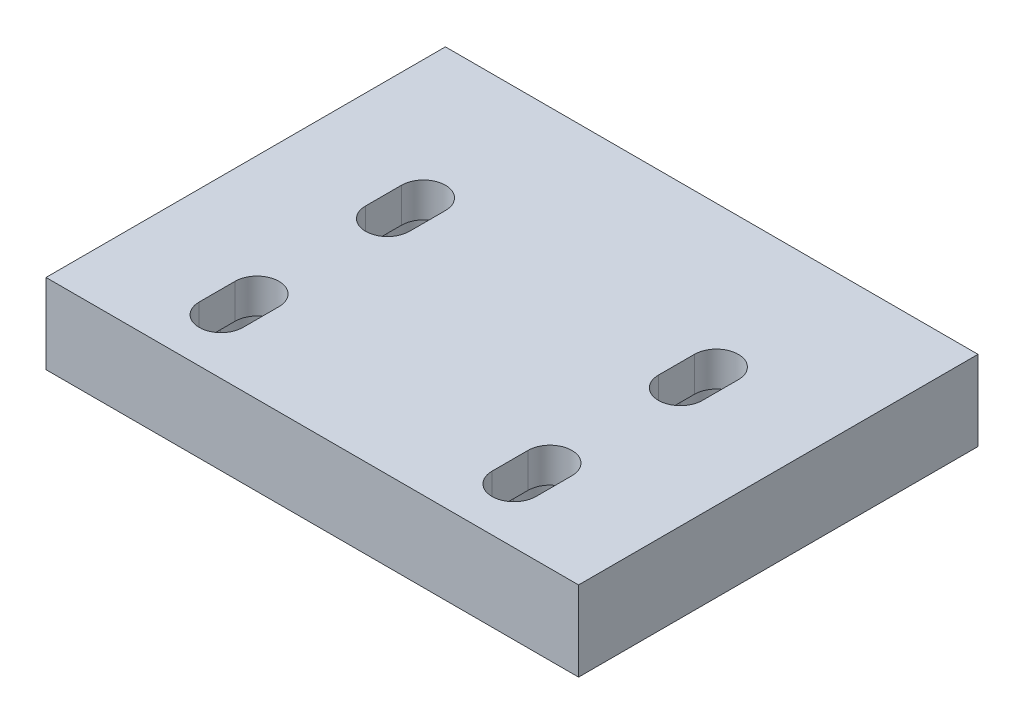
ISO-10303-21;
HEADER;
FILE_DESCRIPTION(('STEP AP214'),'2;1');
FILE_NAME('part.step','',(''),(''),'','','');
FILE_SCHEMA(('AUTOMOTIVE_DESIGN { 1 0 10303 214 1 1 1 1 }'));
ENDSEC;
DATA;
#1=APPLICATION_CONTEXT('core data for automotive mechanical design processes');
#2=APPLICATION_PROTOCOL_DEFINITION('international standard','automotive_design',2000,#1);
#3=PRODUCT_CONTEXT('',#1,'mechanical');
#4=PRODUCT('Part','Part','',(#3));
#5=PRODUCT_RELATED_PRODUCT_CATEGORY('part','',(#4));
#6=PRODUCT_DEFINITION_FORMATION('','',#4);
#7=PRODUCT_DEFINITION_CONTEXT('part definition',#1,'design');
#8=PRODUCT_DEFINITION('design','',#6,#7);
#9=PRODUCT_DEFINITION_SHAPE('','',#8);
#10=(LENGTH_UNIT() NAMED_UNIT(*) SI_UNIT(.MILLI.,.METRE.));
#11=(NAMED_UNIT(*) PLANE_ANGLE_UNIT() SI_UNIT($,.RADIAN.));
#12=(NAMED_UNIT(*) SI_UNIT($,.STERADIAN.) SOLID_ANGLE_UNIT());
#13=UNCERTAINTY_MEASURE_WITH_UNIT(LENGTH_MEASURE(1.E-05),#10,'distance_accuracy_value','');
#14=(GEOMETRIC_REPRESENTATION_CONTEXT(3) GLOBAL_UNCERTAINTY_ASSIGNED_CONTEXT((#13)) GLOBAL_UNIT_ASSIGNED_CONTEXT((#10,
#11,#12)) REPRESENTATION_CONTEXT('',''));
#15=CARTESIAN_POINT('',(0.,0.,0.));
#16=DIRECTION('',(0.,0.,1.));
#17=DIRECTION('',(1.,0.,0.));
#18=AXIS2_PLACEMENT_3D('',#15,#16,#17);
#19=CARTESIAN_POINT('',(-40.,-5.,60.));
#20=DIRECTION('',(0.,-1.,0.));
#21=DIRECTION('',(0.,0.,-1.));
#22=AXIS2_PLACEMENT_3D('',#19,#20,#21);
#23=PLANE('',#22);
#24=DIRECTION('',(0.,0.,1.));
#25=VECTOR('',#24,1.);
#26=CARTESIAN_POINT('',(25.3,-5.,21.3));
#27=LINE('',#26,#25);
#28=CARTESIAN_POINT('',(25.3,-5.,21.3));
#29=VERTEX_POINT('',#28);
#30=CARTESIAN_POINT('',(25.3,-5.,26.7));
#31=VERTEX_POINT('',#30);
#32=EDGE_CURVE('E1042',#29,#31,#27,.T.);
#33=ORIENTED_EDGE('',*,*,#32,.T.);
#34=CARTESIAN_POINT('',(22.,-5.,26.7));
#35=DIRECTION('',(0.,-1.,0.));
#36=DIRECTION('',(0.,0.,-1.));
#37=AXIS2_PLACEMENT_3D('',#34,#35,#36);
#38=CIRCLE('',#37,3.3);
#39=CARTESIAN_POINT('',(18.7,-5.,26.7));
#40=VERTEX_POINT('',#39);
#41=EDGE_CURVE('E310',#31,#40,#38,.T.);
#42=ORIENTED_EDGE('',*,*,#41,.T.);
#43=DIRECTION('',(0.,0.,1.));
#44=VECTOR('',#43,1.);
#45=CARTESIAN_POINT('',(18.7,-5.,21.3));
#46=LINE('',#45,#44);
#47=CARTESIAN_POINT('',(18.7,-5.,21.3));
#48=VERTEX_POINT('',#47);
#49=EDGE_CURVE('E1037',#48,#40,#46,.T.);
#50=ORIENTED_EDGE('',*,*,#49,.F.);
#51=CARTESIAN_POINT('',(22.,-5.,21.3));
#52=DIRECTION('',(0.,-1.,0.));
#53=DIRECTION('',(0.,0.,-1.));
#54=AXIS2_PLACEMENT_3D('',#51,#52,#53);
#55=CIRCLE('',#54,3.3);
#56=EDGE_CURVE('E292',#48,#29,#55,.T.);
#57=ORIENTED_EDGE('',*,*,#56,.T.);
#58=EDGE_LOOP('',(#33,#42,#50,#57));
#59=FACE_BOUND('',#58,.T.);
#60=DIRECTION('',(-1.,0.,0.));
#61=VECTOR('',#60,1.);
#62=CARTESIAN_POINT('',(-40.,-5.,0.));
#63=LINE('',#62,#61);
#64=CARTESIAN_POINT('',(40.,-5.,0.));
#65=VERTEX_POINT('',#64);
#66=CARTESIAN_POINT('',(-40.,-5.,0.));
#67=VERTEX_POINT('',#66);
#68=EDGE_CURVE('E519',#65,#67,#63,.T.);
#69=ORIENTED_EDGE('',*,*,#68,.T.);
#70=DIRECTION('',(0.,0.,-1.));
#71=VECTOR('',#70,1.);
#72=CARTESIAN_POINT('',(-40.,-5.,60.));
#73=LINE('',#72,#71);
#74=CARTESIAN_POINT('',(-40.,-5.,60.));
#75=VERTEX_POINT('',#74);
#76=EDGE_CURVE('E525',#75,#67,#73,.T.);
#77=ORIENTED_EDGE('',*,*,#76,.F.);
#78=DIRECTION('',(-1.,0.,0.));
#79=VECTOR('',#78,1.);
#80=CARTESIAN_POINT('',(-40.,-5.,60.));
#81=LINE('',#80,#79);
#82=CARTESIAN_POINT('',(40.,-5.,60.));
#83=VERTEX_POINT('',#82);
#84=EDGE_CURVE('E523',#83,#75,#81,.T.);
#85=ORIENTED_EDGE('',*,*,#84,.F.);
#86=DIRECTION('',(0.,0.,-1.));
#87=VECTOR('',#86,1.);
#88=CARTESIAN_POINT('',(40.,-5.,60.));
#89=LINE('',#88,#87);
#90=EDGE_CURVE('E535',#83,#65,#89,.T.);
#91=ORIENTED_EDGE('',*,*,#90,.T.);
#92=EDGE_LOOP('',(#69,#77,#85,#91));
#93=FACE_BOUND('',#92,.T.);
#94=DIRECTION('',(0.,0.,1.));
#95=VECTOR('',#94,1.);
#96=CARTESIAN_POINT('',(-18.7,-5.,46.3));
#97=LINE('',#96,#95);
#98=CARTESIAN_POINT('',(-18.7,-5.,46.3));
#99=VERTEX_POINT('',#98);
#100=CARTESIAN_POINT('',(-18.7,-5.,51.7));
#101=VERTEX_POINT('',#100);
#102=EDGE_CURVE('E441',#99,#101,#97,.T.);
#103=ORIENTED_EDGE('',*,*,#102,.T.);
#104=CARTESIAN_POINT('',(-22.,-5.,51.7));
#105=DIRECTION('',(0.,-1.,0.));
#106=DIRECTION('',(0.,0.,-1.));
#107=AXIS2_PLACEMENT_3D('',#104,#105,#106);
#108=CIRCLE('',#107,3.3);
#109=CARTESIAN_POINT('',(-25.3,-5.,51.7));
#110=VERTEX_POINT('',#109);
#111=EDGE_CURVE('E491',#101,#110,#108,.T.);
#112=ORIENTED_EDGE('',*,*,#111,.T.);
#113=DIRECTION('',(0.,0.,1.));
#114=VECTOR('',#113,1.);
#115=CARTESIAN_POINT('',(-25.3,-5.,46.3));
#116=LINE('',#115,#114);
#117=CARTESIAN_POINT('',(-25.3,-5.,46.3));
#118=VERTEX_POINT('',#117);
#119=EDGE_CURVE('E444',#118,#110,#116,.T.);
#120=ORIENTED_EDGE('',*,*,#119,.F.);
#121=CARTESIAN_POINT('',(-22.,-5.,46.3));
#122=DIRECTION('',(0.,-1.,0.));
#123=DIRECTION('',(0.,0.,-1.));
#124=AXIS2_PLACEMENT_3D('',#121,#122,#123);
#125=CIRCLE('',#124,3.3);
#126=EDGE_CURVE('E468',#118,#99,#125,.T.);
#127=ORIENTED_EDGE('',*,*,#126,.T.);
#128=EDGE_LOOP('',(#103,#112,#120,#127));
#129=FACE_BOUND('',#128,.T.);
#130=DIRECTION('',(0.,0.,1.));
#131=VECTOR('',#130,1.);
#132=CARTESIAN_POINT('',(-18.7,-5.,21.3));
#133=LINE('',#132,#131);
#134=CARTESIAN_POINT('',(-18.7,-5.,21.3));
#135=VERTEX_POINT('',#134);
#136=CARTESIAN_POINT('',(-18.7,-5.,26.7));
#137=VERTEX_POINT('',#136);
#138=EDGE_CURVE('E381',#135,#137,#133,.T.);
#139=ORIENTED_EDGE('',*,*,#138,.T.);
#140=CARTESIAN_POINT('',(-22.,-5.,26.7));
#141=DIRECTION('',(0.,-1.,0.));
#142=DIRECTION('',(0.,0.,-1.));
#143=AXIS2_PLACEMENT_3D('',#140,#141,#142);
#144=CIRCLE('',#143,3.3);
#145=CARTESIAN_POINT('',(-25.3,-5.,26.7));
#146=VERTEX_POINT('',#145);
#147=EDGE_CURVE('E430',#137,#146,#144,.T.);
#148=ORIENTED_EDGE('',*,*,#147,.T.);
#149=DIRECTION('',(0.,0.,1.));
#150=VECTOR('',#149,1.);
#151=CARTESIAN_POINT('',(-25.3,-5.,21.3));
#152=LINE('',#151,#150);
#153=CARTESIAN_POINT('',(-25.3,-5.,21.3));
#154=VERTEX_POINT('',#153);
#155=EDGE_CURVE('E384',#154,#146,#152,.T.);
#156=ORIENTED_EDGE('',*,*,#155,.F.);
#157=CARTESIAN_POINT('',(-22.,-5.,21.3));
#158=DIRECTION('',(0.,-1.,0.));
#159=DIRECTION('',(0.,0.,-1.));
#160=AXIS2_PLACEMENT_3D('',#157,#158,#159);
#161=CIRCLE('',#160,3.3);
#162=EDGE_CURVE('E408',#154,#135,#161,.T.);
#163=ORIENTED_EDGE('',*,*,#162,.T.);
#164=EDGE_LOOP('',(#139,#148,#156,#163));
#165=FACE_BOUND('',#164,.T.);
#166=DIRECTION('',(0.,0.,1.));
#167=VECTOR('',#166,1.);
#168=CARTESIAN_POINT('',(18.7,-5.,46.3));
#169=LINE('',#168,#167);
#170=CARTESIAN_POINT('',(18.7,-5.,46.3));
#171=VERTEX_POINT('',#170);
#172=CARTESIAN_POINT('',(18.7,-5.,51.7));
#173=VERTEX_POINT('',#172);
#174=EDGE_CURVE('E324',#171,#173,#169,.T.);
#175=ORIENTED_EDGE('',*,*,#174,.F.);
#176=CARTESIAN_POINT('',(22.,-5.,46.3));
#177=DIRECTION('',(0.,-1.,0.));
#178=DIRECTION('',(0.,0.,-1.));
#179=AXIS2_PLACEMENT_3D('',#176,#177,#178);
#180=CIRCLE('',#179,3.3);
#181=CARTESIAN_POINT('',(25.3,-5.,46.3));
#182=VERTEX_POINT('',#181);
#183=EDGE_CURVE('E348',#171,#182,#180,.T.);
#184=ORIENTED_EDGE('',*,*,#183,.T.);
#185=DIRECTION('',(0.,0.,1.));
#186=VECTOR('',#185,1.);
#187=CARTESIAN_POINT('',(25.3,-5.,46.3));
#188=LINE('',#187,#186);
#189=CARTESIAN_POINT('',(25.3,-5.,51.7));
#190=VERTEX_POINT('',#189);
#191=EDGE_CURVE('E321',#182,#190,#188,.T.);
#192=ORIENTED_EDGE('',*,*,#191,.T.);
#193=CARTESIAN_POINT('',(22.,-5.,51.7));
#194=DIRECTION('',(0.,-1.,0.));
#195=DIRECTION('',(0.,0.,-1.));
#196=AXIS2_PLACEMENT_3D('',#193,#194,#195);
#197=CIRCLE('',#196,3.3);
#198=EDGE_CURVE('E370',#190,#173,#197,.T.);
#199=ORIENTED_EDGE('',*,*,#198,.T.);
#200=EDGE_LOOP('',(#175,#184,#192,#199));
#201=FACE_BOUND('',#200,.T.);
#202=ADVANCED_FACE('F16',(#59,#93,#129,#165,#201),#23,.F.);
#203=CARTESIAN_POINT('',(-40.,-5.,60.));
#204=DIRECTION('',(1.,0.,0.));
#205=DIRECTION('',(0.,0.,-1.));
#206=AXIS2_PLACEMENT_3D('',#203,#204,#205);
#207=PLANE('',#206);
#208=DIRECTION('',(0.,-1.,0.));
#209=VECTOR('',#208,1.);
#210=CARTESIAN_POINT('',(-40.,-5.,0.));
#211=LINE('',#210,#209);
#212=CARTESIAN_POINT('',(-40.,-17.,0.));
#213=VERTEX_POINT('',#212);
#214=EDGE_CURVE('E514',#67,#213,#211,.T.);
#215=ORIENTED_EDGE('',*,*,#214,.T.);
#216=DIRECTION('',(0.,0.,-1.));
#217=VECTOR('',#216,1.);
#218=CARTESIAN_POINT('',(-40.,-17.,60.));
#219=LINE('',#218,#217);
#220=CARTESIAN_POINT('',(-40.,-17.,60.));
#221=VERTEX_POINT('',#220);
#222=EDGE_CURVE('E11',#221,#213,#219,.T.);
#223=ORIENTED_EDGE('',*,*,#222,.F.);
#224=DIRECTION('',(0.,-1.,0.));
#225=VECTOR('',#224,1.);
#226=CARTESIAN_POINT('',(-40.,-5.,60.));
#227=LINE('',#226,#225);
#228=EDGE_CURVE('E515',#75,#221,#227,.T.);
#229=ORIENTED_EDGE('',*,*,#228,.F.);
#230=ORIENTED_EDGE('',*,*,#76,.T.);
#231=EDGE_LOOP('',(#215,#223,#229,#230));
#232=FACE_BOUND('',#231,.T.);
#233=ADVANCED_FACE('F18',(#232),#207,.F.);
#234=CARTESIAN_POINT('',(-40.,-17.,60.));
#235=DIRECTION('',(0.,1.,0.));
#236=DIRECTION('',(0.,0.,1.));
#237=AXIS2_PLACEMENT_3D('',#234,#235,#236);
#238=PLANE('',#237);
#239=DIRECTION('',(0.,0.,1.));
#240=VECTOR('',#239,1.);
#241=CARTESIAN_POINT('',(16.5,-17.,21.3));
#242=LINE('',#241,#240);
#243=CARTESIAN_POINT('',(16.5,-17.,21.3));
#244=VERTEX_POINT('',#243);
#245=CARTESIAN_POINT('',(16.5,-17.,26.7));
#246=VERTEX_POINT('',#245);
#247=EDGE_CURVE('E286',#244,#246,#242,.T.);
#248=ORIENTED_EDGE('',*,*,#247,.T.);
#249=CARTESIAN_POINT('',(22.,-17.,26.7));
#250=DIRECTION('',(0.,-1.,0.));
#251=DIRECTION('',(0.,0.,-1.));
#252=AXIS2_PLACEMENT_3D('',#249,#250,#251);
#253=CIRCLE('',#252,5.5);
#254=CARTESIAN_POINT('',(27.5,-17.,26.7));
#255=VERTEX_POINT('',#254);
#256=EDGE_CURVE('E302',#255,#246,#253,.T.);
#257=ORIENTED_EDGE('',*,*,#256,.F.);
#258=DIRECTION('',(0.,0.,1.));
#259=VECTOR('',#258,1.);
#260=CARTESIAN_POINT('',(27.5,-17.,21.3));
#261=LINE('',#260,#259);
#262=CARTESIAN_POINT('',(27.5,-17.,21.3));
#263=VERTEX_POINT('',#262);
#264=EDGE_CURVE('E276',#263,#255,#261,.T.);
#265=ORIENTED_EDGE('',*,*,#264,.F.);
#266=CARTESIAN_POINT('',(22.,-17.,21.3));
#267=DIRECTION('',(0.,-1.,0.));
#268=DIRECTION('',(0.,0.,-1.));
#269=AXIS2_PLACEMENT_3D('',#266,#267,#268);
#270=CIRCLE('',#269,5.5);
#271=EDGE_CURVE('E269',#244,#263,#270,.T.);
#272=ORIENTED_EDGE('',*,*,#271,.F.);
#273=EDGE_LOOP('',(#248,#257,#265,#272));
#274=FACE_BOUND('',#273,.T.);
#275=CARTESIAN_POINT('',(22.,-17.,46.3));
#276=DIRECTION('',(0.,-1.,0.));
#277=DIRECTION('',(0.,0.,-1.));
#278=AXIS2_PLACEMENT_3D('',#275,#276,#277);
#279=CIRCLE('',#278,5.5);
#280=CARTESIAN_POINT('',(16.5,-17.,46.3));
#281=VERTEX_POINT('',#280);
#282=CARTESIAN_POINT('',(27.5,-17.,46.3));
#283=VERTEX_POINT('',#282);
#284=EDGE_CURVE('E341',#281,#283,#279,.T.);
#285=ORIENTED_EDGE('',*,*,#284,.F.);
#286=DIRECTION('',(0.,0.,1.));
#287=VECTOR('',#286,1.);
#288=CARTESIAN_POINT('',(16.5,-17.,46.3));
#289=LINE('',#288,#287);
#290=CARTESIAN_POINT('',(16.5,-17.,51.7));
#291=VERTEX_POINT('',#290);
#292=EDGE_CURVE('E330',#281,#291,#289,.T.);
#293=ORIENTED_EDGE('',*,*,#292,.T.);
#294=CARTESIAN_POINT('',(22.,-17.,51.7));
#295=DIRECTION('',(0.,-1.,0.));
#296=DIRECTION('',(0.,0.,-1.));
#297=AXIS2_PLACEMENT_3D('',#294,#295,#296);
#298=CIRCLE('',#297,5.5);
#299=CARTESIAN_POINT('',(27.5,-17.,51.7));
#300=VERTEX_POINT('',#299);
#301=EDGE_CURVE('E361',#300,#291,#298,.T.);
#302=ORIENTED_EDGE('',*,*,#301,.F.);
#303=DIRECTION('',(0.,0.,1.));
#304=VECTOR('',#303,1.);
#305=CARTESIAN_POINT('',(27.5,-17.,46.3));
#306=LINE('',#305,#304);
#307=EDGE_CURVE('E315',#283,#300,#306,.T.);
#308=ORIENTED_EDGE('',*,*,#307,.F.);
#309=EDGE_LOOP('',(#285,#293,#302,#308));
#310=FACE_BOUND('',#309,.T.);
#311=CARTESIAN_POINT('',(-22.,-17.,21.3));
#312=DIRECTION('',(0.,-1.,0.));
#313=DIRECTION('',(0.,0.,-1.));
#314=AXIS2_PLACEMENT_3D('',#311,#312,#313);
#315=CIRCLE('',#314,5.5);
#316=CARTESIAN_POINT('',(-27.5,-17.,21.3));
#317=VERTEX_POINT('',#316);
#318=CARTESIAN_POINT('',(-16.5,-17.,21.3));
#319=VERTEX_POINT('',#318);
#320=EDGE_CURVE('E401',#317,#319,#315,.T.);
#321=ORIENTED_EDGE('',*,*,#320,.F.);
#322=DIRECTION('',(0.,0.,1.));
#323=VECTOR('',#322,1.);
#324=CARTESIAN_POINT('',(-27.5,-17.,21.3));
#325=LINE('',#324,#323);
#326=CARTESIAN_POINT('',(-27.5,-17.,26.7));
#327=VERTEX_POINT('',#326);
#328=EDGE_CURVE('E390',#317,#327,#325,.T.);
#329=ORIENTED_EDGE('',*,*,#328,.T.);
#330=CARTESIAN_POINT('',(-22.,-17.,26.7));
#331=DIRECTION('',(0.,-1.,0.));
#332=DIRECTION('',(0.,0.,-1.));
#333=AXIS2_PLACEMENT_3D('',#330,#331,#332);
#334=CIRCLE('',#333,5.5);
#335=CARTESIAN_POINT('',(-16.5,-17.,26.7));
#336=VERTEX_POINT('',#335);
#337=EDGE_CURVE('E421',#336,#327,#334,.T.);
#338=ORIENTED_EDGE('',*,*,#337,.F.);
#339=DIRECTION('',(0.,0.,1.));
#340=VECTOR('',#339,1.);
#341=CARTESIAN_POINT('',(-16.5,-17.,21.3));
#342=LINE('',#341,#340);
#343=EDGE_CURVE('E375',#319,#336,#342,.T.);
#344=ORIENTED_EDGE('',*,*,#343,.F.);
#345=EDGE_LOOP('',(#321,#329,#338,#344));
#346=FACE_BOUND('',#345,.T.);
#347=DIRECTION('',(0.,0.,1.));
#348=VECTOR('',#347,1.);
#349=CARTESIAN_POINT('',(-27.5,-17.,46.3));
#350=LINE('',#349,#348);
#351=CARTESIAN_POINT('',(-27.5,-17.,46.3));
#352=VERTEX_POINT('',#351);
#353=CARTESIAN_POINT('',(-27.5,-17.,51.7));
#354=VERTEX_POINT('',#353);
#355=EDGE_CURVE('E450',#352,#354,#350,.T.);
#356=ORIENTED_EDGE('',*,*,#355,.T.);
#357=CARTESIAN_POINT('',(-22.,-17.,51.7));
#358=DIRECTION('',(0.,-1.,0.));
#359=DIRECTION('',(0.,0.,-1.));
#360=AXIS2_PLACEMENT_3D('',#357,#358,#359);
#361=CIRCLE('',#360,5.5);
#362=CARTESIAN_POINT('',(-16.5,-17.,51.7));
#363=VERTEX_POINT('',#362);
#364=EDGE_CURVE('E482',#363,#354,#361,.T.);
#365=ORIENTED_EDGE('',*,*,#364,.F.);
#366=DIRECTION('',(0.,0.,1.));
#367=VECTOR('',#366,1.);
#368=CARTESIAN_POINT('',(-16.5,-17.,46.3));
#369=LINE('',#368,#367);
#370=CARTESIAN_POINT('',(-16.5,-17.,46.3));
#371=VERTEX_POINT('',#370);
#372=EDGE_CURVE('E435',#371,#363,#369,.T.);
#373=ORIENTED_EDGE('',*,*,#372,.F.);
#374=CARTESIAN_POINT('',(-22.,-17.,46.3));
#375=DIRECTION('',(0.,-1.,0.));
#376=DIRECTION('',(0.,0.,-1.));
#377=AXIS2_PLACEMENT_3D('',#374,#375,#376);
#378=CIRCLE('',#377,5.5);
#379=EDGE_CURVE('E462',#352,#371,#378,.T.);
#380=ORIENTED_EDGE('',*,*,#379,.F.);
#381=EDGE_LOOP('',(#356,#365,#373,#380));
#382=FACE_BOUND('',#381,.T.);
#383=DIRECTION('',(1.,0.,0.));
#384=VECTOR('',#383,1.);
#385=CARTESIAN_POINT('',(-40.,-17.,0.));
#386=LINE('',#385,#384);
#387=CARTESIAN_POINT('',(40.,-17.,0.));
#388=VERTEX_POINT('',#387);
#389=EDGE_CURVE('E528',#213,#388,#386,.T.);
#390=ORIENTED_EDGE('',*,*,#389,.T.);
#391=DIRECTION('',(0.,0.,-1.));
#392=VECTOR('',#391,1.);
#393=CARTESIAN_POINT('',(40.,-17.,60.));
#394=LINE('',#393,#392);
#395=CARTESIAN_POINT('',(40.,-17.,60.));
#396=VERTEX_POINT('',#395);
#397=EDGE_CURVE('E24',#396,#388,#394,.T.);
#398=ORIENTED_EDGE('',*,*,#397,.F.);
#399=DIRECTION('',(1.,0.,0.));
#400=VECTOR('',#399,1.);
#401=CARTESIAN_POINT('',(-40.,-17.,60.));
#402=LINE('',#401,#400);
#403=EDGE_CURVE('E518',#221,#396,#402,.T.);
#404=ORIENTED_EDGE('',*,*,#403,.F.);
#405=ORIENTED_EDGE('',*,*,#222,.T.);
#406=EDGE_LOOP('',(#390,#398,#404,#405));
#407=FACE_BOUND('',#406,.T.);
#408=ADVANCED_FACE('F558',(#274,#310,#346,#382,#407),#238,.F.);
#409=CARTESIAN_POINT('',(40.,-5.,60.));
#410=DIRECTION('',(-1.,0.,0.));
#411=DIRECTION('',(0.,0.,1.));
#412=AXIS2_PLACEMENT_3D('',#409,#410,#411);
#413=PLANE('',#412);
#414=DIRECTION('',(0.,1.,0.));
#415=VECTOR('',#414,1.);
#416=CARTESIAN_POINT('',(40.,-5.,0.));
#417=LINE('',#416,#415);
#418=EDGE_CURVE('E530',#388,#65,#417,.T.);
#419=ORIENTED_EDGE('',*,*,#418,.T.);
#420=ORIENTED_EDGE('',*,*,#90,.F.);
#421=DIRECTION('',(0.,1.,0.));
#422=VECTOR('',#421,1.);
#423=CARTESIAN_POINT('',(40.,-5.,60.));
#424=LINE('',#423,#422);
#425=EDGE_CURVE('E521',#396,#83,#424,.T.);
#426=ORIENTED_EDGE('',*,*,#425,.F.);
#427=ORIENTED_EDGE('',*,*,#397,.T.);
#428=EDGE_LOOP('',(#419,#420,#426,#427));
#429=FACE_BOUND('',#428,.T.);
#430=ADVANCED_FACE('F542',(#429),#413,.F.);
#431=CARTESIAN_POINT('',(0.,0.,60.));
#432=DIRECTION('',(0.,0.,1.));
#433=DIRECTION('',(1.,0.,0.));
#434=AXIS2_PLACEMENT_3D('',#431,#432,#433);
#435=PLANE('',#434);
#436=ORIENTED_EDGE('',*,*,#228,.T.);
#437=ORIENTED_EDGE('',*,*,#403,.T.);
#438=ORIENTED_EDGE('',*,*,#425,.T.);
#439=ORIENTED_EDGE('',*,*,#84,.T.);
#440=EDGE_LOOP('',(#436,#437,#438,#439));
#441=FACE_BOUND('',#440,.T.);
#442=ADVANCED_FACE('F557',(#441),#435,.T.);
#443=CARTESIAN_POINT('',(0.,0.,0.));
#444=DIRECTION('',(0.,0.,1.));
#445=DIRECTION('',(1.,0.,0.));
#446=AXIS2_PLACEMENT_3D('',#443,#444,#445);
#447=PLANE('',#446);
#448=CARTESIAN_POINT('',(28.,-11.,0.));
#449=DIRECTION('',(0.,0.,-1.));
#450=DIRECTION('',(-1.,0.,0.));
#451=AXIS2_PLACEMENT_3D('',#448,#449,#450);
#452=CIRCLE('',#451,2.1);
#453=CARTESIAN_POINT('',(25.9,-11.,0.));
#454=VERTEX_POINT('',#453);
#455=EDGE_CURVE('E496',#454,#454,#452,.T.);
#456=ORIENTED_EDGE('',*,*,#455,.F.);
#457=EDGE_LOOP('',(#456));
#458=FACE_BOUND('',#457,.T.);
#459=CARTESIAN_POINT('',(0.,-11.,0.));
#460=DIRECTION('',(0.,0.,-1.));
#461=DIRECTION('',(-1.,0.,0.));
#462=AXIS2_PLACEMENT_3D('',#459,#460,#461);
#463=CIRCLE('',#462,2.1);
#464=CARTESIAN_POINT('',(-2.1,-11.,0.));
#465=VERTEX_POINT('',#464);
#466=EDGE_CURVE('E502',#465,#465,#463,.T.);
#467=ORIENTED_EDGE('',*,*,#466,.F.);
#468=EDGE_LOOP('',(#467));
#469=FACE_BOUND('',#468,.T.);
#470=CARTESIAN_POINT('',(-28.,-11.,0.));
#471=DIRECTION('',(0.,0.,-1.));
#472=DIRECTION('',(-1.,0.,0.));
#473=AXIS2_PLACEMENT_3D('',#470,#471,#472);
#474=CIRCLE('',#473,2.1);
#475=CARTESIAN_POINT('',(-30.1,-11.,0.));
#476=VERTEX_POINT('',#475);
#477=EDGE_CURVE('E508',#476,#476,#474,.T.);
#478=ORIENTED_EDGE('',*,*,#477,.F.);
#479=EDGE_LOOP('',(#478));
#480=FACE_BOUND('',#479,.T.);
#481=ORIENTED_EDGE('',*,*,#214,.F.);
#482=ORIENTED_EDGE('',*,*,#68,.F.);
#483=ORIENTED_EDGE('',*,*,#418,.F.);
#484=ORIENTED_EDGE('',*,*,#389,.F.);
#485=EDGE_LOOP('',(#481,#482,#483,#484));
#486=FACE_BOUND('',#485,.T.);
#487=ADVANCED_FACE('F548',(#458,#469,#480,#486),#447,.F.);
#488=CARTESIAN_POINT('',(-28.,-11.,16.));
#489=DIRECTION('',(0.,0.,-1.));
#490=DIRECTION('',(-1.,0.,0.));
#491=AXIS2_PLACEMENT_3D('',#488,#489,#490);
#492=CONICAL_SURFACE('',#491,2.1,1.02974425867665);
#493=CARTESIAN_POINT('',(-28.,-11.,17.2618072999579));
#494=VERTEX_POINT('',#493);
#495=VERTEX_LOOP('',#494);
#496=FACE_BOUND('',#495,.T.);
#497=CARTESIAN_POINT('',(-28.,-11.,16.));
#498=DIRECTION('',(0.,0.,-1.));
#499=DIRECTION('',(-1.,0.,0.));
#500=AXIS2_PLACEMENT_3D('',#497,#498,#499);
#501=CIRCLE('',#500,2.1);
#502=CARTESIAN_POINT('',(-30.1,-11.,16.));
#503=VERTEX_POINT('',#502);
#504=EDGE_CURVE('E511',#503,#503,#501,.T.);
#505=ORIENTED_EDGE('',*,*,#504,.T.);
#506=EDGE_LOOP('',(#505));
#507=FACE_BOUND('',#506,.T.);
#508=ADVANCED_FACE('F580',(#496,#507),#492,.F.);
#509=CARTESIAN_POINT('',(-28.,-11.,0.));
#510=DIRECTION('',(0.,0.,-1.));
#511=DIRECTION('',(-1.,0.,0.));
#512=AXIS2_PLACEMENT_3D('',#509,#510,#511);
#513=CYLINDRICAL_SURFACE('',#512,2.1);
#514=ORIENTED_EDGE('',*,*,#504,.F.);
#515=EDGE_LOOP('',(#514));
#516=FACE_BOUND('',#515,.T.);
#517=ORIENTED_EDGE('',*,*,#477,.T.);
#518=EDGE_LOOP('',(#517));
#519=FACE_BOUND('',#518,.T.);
#520=ADVANCED_FACE('F586',(#516,#519),#513,.F.);
#521=CARTESIAN_POINT('',(0.,-11.,16.));
#522=DIRECTION('',(0.,0.,-1.));
#523=DIRECTION('',(-1.,0.,0.));
#524=AXIS2_PLACEMENT_3D('',#521,#522,#523);
#525=CONICAL_SURFACE('',#524,2.1,1.02974425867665);
#526=CARTESIAN_POINT('',(0.,-11.,17.2618072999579));
#527=VERTEX_POINT('',#526);
#528=VERTEX_LOOP('',#527);
#529=FACE_BOUND('',#528,.T.);
#530=CARTESIAN_POINT('',(0.,-11.,16.));
#531=DIRECTION('',(0.,0.,-1.));
#532=DIRECTION('',(-1.,0.,0.));
#533=AXIS2_PLACEMENT_3D('',#530,#531,#532);
#534=CIRCLE('',#533,2.1);
#535=CARTESIAN_POINT('',(-2.1,-11.,16.));
#536=VERTEX_POINT('',#535);
#537=EDGE_CURVE('E505',#536,#536,#534,.T.);
#538=ORIENTED_EDGE('',*,*,#537,.T.);
#539=EDGE_LOOP('',(#538));
#540=FACE_BOUND('',#539,.T.);
#541=ADVANCED_FACE('F590',(#529,#540),#525,.F.);
#542=CARTESIAN_POINT('',(0.,-11.,0.));
#543=DIRECTION('',(0.,0.,-1.));
#544=DIRECTION('',(-1.,0.,0.));
#545=AXIS2_PLACEMENT_3D('',#542,#543,#544);
#546=CYLINDRICAL_SURFACE('',#545,2.1);
#547=ORIENTED_EDGE('',*,*,#537,.F.);
#548=EDGE_LOOP('',(#547));
#549=FACE_BOUND('',#548,.T.);
#550=ORIENTED_EDGE('',*,*,#466,.T.);
#551=EDGE_LOOP('',(#550));
#552=FACE_BOUND('',#551,.T.);
#553=ADVANCED_FACE('F594',(#549,#552),#546,.F.);
#554=CARTESIAN_POINT('',(28.,-11.,16.));
#555=DIRECTION('',(0.,0.,-1.));
#556=DIRECTION('',(-1.,0.,0.));
#557=AXIS2_PLACEMENT_3D('',#554,#555,#556);
#558=CONICAL_SURFACE('',#557,2.1,1.02974425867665);
#559=CARTESIAN_POINT('',(28.,-11.,17.2618072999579));
#560=VERTEX_POINT('',#559);
#561=VERTEX_LOOP('',#560);
#562=FACE_BOUND('',#561,.T.);
#563=CARTESIAN_POINT('',(28.,-11.,16.));
#564=DIRECTION('',(0.,0.,-1.));
#565=DIRECTION('',(-1.,0.,0.));
#566=AXIS2_PLACEMENT_3D('',#563,#564,#565);
#567=CIRCLE('',#566,2.1);
#568=CARTESIAN_POINT('',(25.9,-11.,16.));
#569=VERTEX_POINT('',#568);
#570=EDGE_CURVE('E499',#569,#569,#567,.T.);
#571=ORIENTED_EDGE('',*,*,#570,.T.);
#572=EDGE_LOOP('',(#571));
#573=FACE_BOUND('',#572,.T.);
#574=ADVANCED_FACE('F598',(#562,#573),#558,.F.);
#575=CARTESIAN_POINT('',(28.,-11.,0.));
#576=DIRECTION('',(0.,0.,-1.));
#577=DIRECTION('',(-1.,0.,0.));
#578=AXIS2_PLACEMENT_3D('',#575,#576,#577);
#579=CYLINDRICAL_SURFACE('',#578,2.1);
#580=ORIENTED_EDGE('',*,*,#570,.F.);
#581=EDGE_LOOP('',(#580));
#582=FACE_BOUND('',#581,.T.);
#583=ORIENTED_EDGE('',*,*,#455,.T.);
#584=EDGE_LOOP('',(#583));
#585=FACE_BOUND('',#584,.T.);
#586=ADVANCED_FACE('F602',(#582,#585),#579,.F.);
#587=CARTESIAN_POINT('',(-22.,-17.,51.7));
#588=DIRECTION('',(0.,-1.,0.));
#589=DIRECTION('',(0.,0.,-1.));
#590=AXIS2_PLACEMENT_3D('',#587,#588,#589);
#591=CYLINDRICAL_SURFACE('',#590,3.3);
#592=ORIENTED_EDGE('',*,*,#111,.F.);
#593=DIRECTION('',(0.,1.,0.));
#594=VECTOR('',#593,1.);
#595=CARTESIAN_POINT('',(-18.7,-5.,51.7));
#596=LINE('',#595,#594);
#597=CARTESIAN_POINT('',(-18.7,-10.2,51.7));
#598=VERTEX_POINT('',#597);
#599=EDGE_CURVE('E479',#598,#101,#596,.T.);
#600=ORIENTED_EDGE('',*,*,#599,.F.);
#601=CARTESIAN_POINT('',(-22.,-10.2,51.7));
#602=DIRECTION('',(0.,-1.,0.));
#603=DIRECTION('',(0.,0.,-1.));
#604=AXIS2_PLACEMENT_3D('',#601,#602,#603);
#605=CIRCLE('',#604,3.3);
#606=CARTESIAN_POINT('',(-25.3,-10.2,51.7));
#607=VERTEX_POINT('',#606);
#608=EDGE_CURVE('E488',#598,#607,#605,.T.);
#609=ORIENTED_EDGE('',*,*,#608,.T.);
#610=DIRECTION('',(0.,-1.,0.));
#611=VECTOR('',#610,1.);
#612=CARTESIAN_POINT('',(-25.3,-17.,51.7));
#613=LINE('',#612,#611);
#614=EDGE_CURVE('E473',#110,#607,#613,.T.);
#615=ORIENTED_EDGE('',*,*,#614,.F.);
#616=EDGE_LOOP('',(#592,#600,#609,#615));
#617=FACE_BOUND('',#616,.T.);
#618=ADVANCED_FACE('F606',(#617),#591,.F.);
#619=CARTESIAN_POINT('',(-18.7,-10.2,51.7));
#620=DIRECTION('',(0.,1.,0.));
#621=DIRECTION('',(0.,0.,1.));
#622=AXIS2_PLACEMENT_3D('',#619,#620,#621);
#623=PLANE('',#622);
#624=DIRECTION('',(0.,0.,1.));
#625=VECTOR('',#624,1.);
#626=CARTESIAN_POINT('',(-27.5,-10.2,46.3));
#627=LINE('',#626,#625);
#628=CARTESIAN_POINT('',(-27.5,-10.2,46.3));
#629=VERTEX_POINT('',#628);
#630=CARTESIAN_POINT('',(-27.5,-10.2,51.7));
#631=VERTEX_POINT('',#630);
#632=EDGE_CURVE('E448',#629,#631,#627,.T.);
#633=ORIENTED_EDGE('',*,*,#632,.F.);
#634=CARTESIAN_POINT('',(-22.,-10.2,46.3));
#635=DIRECTION('',(0.,-1.,0.));
#636=DIRECTION('',(0.,0.,-1.));
#637=AXIS2_PLACEMENT_3D('',#634,#635,#636);
#638=CIRCLE('',#637,5.5);
#639=CARTESIAN_POINT('',(-16.5,-10.2,46.3));
#640=VERTEX_POINT('',#639);
#641=EDGE_CURVE('E464',#629,#640,#638,.T.);
#642=ORIENTED_EDGE('',*,*,#641,.T.);
#643=DIRECTION('',(0.,0.,1.));
#644=VECTOR('',#643,1.);
#645=CARTESIAN_POINT('',(-16.5,-10.2,46.3));
#646=LINE('',#645,#644);
#647=CARTESIAN_POINT('',(-16.5,-10.2,51.7));
#648=VERTEX_POINT('',#647);
#649=EDGE_CURVE('E437',#640,#648,#646,.T.);
#650=ORIENTED_EDGE('',*,*,#649,.T.);
#651=CARTESIAN_POINT('',(-22.,-10.2,51.7));
#652=DIRECTION('',(0.,-1.,0.));
#653=DIRECTION('',(0.,0.,-1.));
#654=AXIS2_PLACEMENT_3D('',#651,#652,#653);
#655=CIRCLE('',#654,5.5);
#656=EDGE_CURVE('E485',#648,#631,#655,.T.);
#657=ORIENTED_EDGE('',*,*,#656,.T.);
#658=EDGE_LOOP('',(#633,#642,#650,#657));
#659=FACE_BOUND('',#658,.T.);
#660=ORIENTED_EDGE('',*,*,#608,.F.);
#661=DIRECTION('',(0.,0.,1.));
#662=VECTOR('',#661,1.);
#663=CARTESIAN_POINT('',(-18.7,-10.2,46.3));
#664=LINE('',#663,#662);
#665=CARTESIAN_POINT('',(-18.7,-10.2,46.3));
#666=VERTEX_POINT('',#665);
#667=EDGE_CURVE('E439',#666,#598,#664,.T.);
#668=ORIENTED_EDGE('',*,*,#667,.F.);
#669=CARTESIAN_POINT('',(-22.,-10.2,46.3));
#670=DIRECTION('',(0.,-1.,0.));
#671=DIRECTION('',(0.,0.,-1.));
#672=AXIS2_PLACEMENT_3D('',#669,#670,#671);
#673=CIRCLE('',#672,3.3);
#674=CARTESIAN_POINT('',(-25.3,-10.2,46.3));
#675=VERTEX_POINT('',#674);
#676=EDGE_CURVE('E466',#675,#666,#673,.T.);
#677=ORIENTED_EDGE('',*,*,#676,.F.);
#678=DIRECTION('',(0.,0.,1.));
#679=VECTOR('',#678,1.);
#680=CARTESIAN_POINT('',(-25.3,-10.2,46.3));
#681=LINE('',#680,#679);
#682=EDGE_CURVE('E446',#675,#607,#681,.T.);
#683=ORIENTED_EDGE('',*,*,#682,.T.);
#684=EDGE_LOOP('',(#660,#668,#677,#683));
#685=FACE_BOUND('',#684,.T.);
#686=ADVANCED_FACE('F610',(#659,#685),#623,.F.);
#687=CARTESIAN_POINT('',(-22.,-17.,51.7));
#688=DIRECTION('',(0.,-1.,0.));
#689=DIRECTION('',(0.,0.,-1.));
#690=AXIS2_PLACEMENT_3D('',#687,#688,#689);
#691=CYLINDRICAL_SURFACE('',#690,5.5);
#692=ORIENTED_EDGE('',*,*,#656,.F.);
#693=DIRECTION('',(0.,1.,0.));
#694=VECTOR('',#693,1.);
#695=CARTESIAN_POINT('',(-16.5,-10.2,51.7));
#696=LINE('',#695,#694);
#697=EDGE_CURVE('E476',#363,#648,#696,.T.);
#698=ORIENTED_EDGE('',*,*,#697,.F.);
#699=ORIENTED_EDGE('',*,*,#364,.T.);
#700=DIRECTION('',(0.,-1.,0.));
#701=VECTOR('',#700,1.);
#702=CARTESIAN_POINT('',(-27.5,-17.,51.7));
#703=LINE('',#702,#701);
#704=EDGE_CURVE('E494',#631,#354,#703,.T.);
#705=ORIENTED_EDGE('',*,*,#704,.F.);
#706=EDGE_LOOP('',(#692,#698,#699,#705));
#707=FACE_BOUND('',#706,.T.);
#708=ADVANCED_FACE('F614',(#707),#691,.F.);
#709=CARTESIAN_POINT('',(-22.,-17.,46.3));
#710=DIRECTION('',(0.,-1.,0.));
#711=DIRECTION('',(0.,0.,-1.));
#712=AXIS2_PLACEMENT_3D('',#709,#710,#711);
#713=CYLINDRICAL_SURFACE('',#712,3.3);
#714=ORIENTED_EDGE('',*,*,#676,.T.);
#715=DIRECTION('',(0.,1.,0.));
#716=VECTOR('',#715,1.);
#717=CARTESIAN_POINT('',(-18.7,-5.,46.3));
#718=LINE('',#717,#716);
#719=EDGE_CURVE('E459',#666,#99,#718,.T.);
#720=ORIENTED_EDGE('',*,*,#719,.T.);
#721=ORIENTED_EDGE('',*,*,#126,.F.);
#722=DIRECTION('',(0.,-1.,0.));
#723=VECTOR('',#722,1.);
#724=CARTESIAN_POINT('',(-25.3,-17.,46.3));
#725=LINE('',#724,#723);
#726=EDGE_CURVE('E453',#675,#118,#725,.F.);
#727=ORIENTED_EDGE('',*,*,#726,.F.);
#728=EDGE_LOOP('',(#714,#720,#721,#727));
#729=FACE_BOUND('',#728,.T.);
#730=ADVANCED_FACE('F618',(#729),#713,.F.);
#731=CARTESIAN_POINT('',(-22.,-17.,46.3));
#732=DIRECTION('',(0.,-1.,0.));
#733=DIRECTION('',(0.,0.,-1.));
#734=AXIS2_PLACEMENT_3D('',#731,#732,#733);
#735=CYLINDRICAL_SURFACE('',#734,5.5);
#736=ORIENTED_EDGE('',*,*,#379,.T.);
#737=DIRECTION('',(0.,1.,0.));
#738=VECTOR('',#737,1.);
#739=CARTESIAN_POINT('',(-16.5,-10.2,46.3));
#740=LINE('',#739,#738);
#741=EDGE_CURVE('E456',#371,#640,#740,.T.);
#742=ORIENTED_EDGE('',*,*,#741,.T.);
#743=ORIENTED_EDGE('',*,*,#641,.F.);
#744=DIRECTION('',(0.,-1.,0.));
#745=VECTOR('',#744,1.);
#746=CARTESIAN_POINT('',(-27.5,-17.,46.3));
#747=LINE('',#746,#745);
#748=EDGE_CURVE('E471',#352,#629,#747,.F.);
#749=ORIENTED_EDGE('',*,*,#748,.F.);
#750=EDGE_LOOP('',(#736,#742,#743,#749));
#751=FACE_BOUND('',#750,.T.);
#752=ADVANCED_FACE('F622',(#751),#735,.F.);
#753=CARTESIAN_POINT('',(-27.5,-17.,46.3));
#754=DIRECTION('',(-1.,0.,0.));
#755=DIRECTION('',(0.,0.,1.));
#756=AXIS2_PLACEMENT_3D('',#753,#754,#755);
#757=PLANE('',#756);
#758=ORIENTED_EDGE('',*,*,#704,.T.);
#759=ORIENTED_EDGE('',*,*,#355,.F.);
#760=ORIENTED_EDGE('',*,*,#748,.T.);
#761=ORIENTED_EDGE('',*,*,#632,.T.);
#762=EDGE_LOOP('',(#758,#759,#760,#761));
#763=FACE_BOUND('',#762,.T.);
#764=ADVANCED_FACE('F626',(#763),#757,.F.);
#765=CARTESIAN_POINT('',(-25.3,-17.,46.3));
#766=DIRECTION('',(-1.,0.,0.));
#767=DIRECTION('',(0.,0.,1.));
#768=AXIS2_PLACEMENT_3D('',#765,#766,#767);
#769=PLANE('',#768);
#770=ORIENTED_EDGE('',*,*,#614,.T.);
#771=ORIENTED_EDGE('',*,*,#682,.F.);
#772=ORIENTED_EDGE('',*,*,#726,.T.);
#773=ORIENTED_EDGE('',*,*,#119,.T.);
#774=EDGE_LOOP('',(#770,#771,#772,#773));
#775=FACE_BOUND('',#774,.T.);
#776=ADVANCED_FACE('F630',(#775),#769,.F.);
#777=CARTESIAN_POINT('',(-18.7,-5.,46.3));
#778=DIRECTION('',(1.,0.,0.));
#779=DIRECTION('',(0.,1.,0.));
#780=AXIS2_PLACEMENT_3D('',#777,#778,#779);
#781=PLANE('',#780);
#782=ORIENTED_EDGE('',*,*,#599,.T.);
#783=ORIENTED_EDGE('',*,*,#102,.F.);
#784=ORIENTED_EDGE('',*,*,#719,.F.);
#785=ORIENTED_EDGE('',*,*,#667,.T.);
#786=EDGE_LOOP('',(#782,#783,#784,#785));
#787=FACE_BOUND('',#786,.T.);
#788=ADVANCED_FACE('F634',(#787),#781,.F.);
#789=CARTESIAN_POINT('',(-16.5,-10.2,46.3));
#790=DIRECTION('',(1.,0.,0.));
#791=DIRECTION('',(0.,1.,0.));
#792=AXIS2_PLACEMENT_3D('',#789,#790,#791);
#793=PLANE('',#792);
#794=ORIENTED_EDGE('',*,*,#697,.T.);
#795=ORIENTED_EDGE('',*,*,#649,.F.);
#796=ORIENTED_EDGE('',*,*,#741,.F.);
#797=ORIENTED_EDGE('',*,*,#372,.T.);
#798=EDGE_LOOP('',(#794,#795,#796,#797));
#799=FACE_BOUND('',#798,.T.);
#800=ADVANCED_FACE('F638',(#799),#793,.F.);
#801=CARTESIAN_POINT('',(-22.,-17.,26.7));
#802=DIRECTION('',(0.,-1.,0.));
#803=DIRECTION('',(0.,0.,-1.));
#804=AXIS2_PLACEMENT_3D('',#801,#802,#803);
#805=CYLINDRICAL_SURFACE('',#804,3.3);
#806=ORIENTED_EDGE('',*,*,#147,.F.);
#807=DIRECTION('',(0.,1.,0.));
#808=VECTOR('',#807,1.);
#809=CARTESIAN_POINT('',(-18.7,-5.,26.7));
#810=LINE('',#809,#808);
#811=CARTESIAN_POINT('',(-18.7,-10.2,26.7));
#812=VERTEX_POINT('',#811);
#813=EDGE_CURVE('E419',#812,#137,#810,.T.);
#814=ORIENTED_EDGE('',*,*,#813,.F.);
#815=CARTESIAN_POINT('',(-22.,-10.2,26.7));
#816=DIRECTION('',(0.,-1.,0.));
#817=DIRECTION('',(0.,0.,-1.));
#818=AXIS2_PLACEMENT_3D('',#815,#816,#817);
#819=CIRCLE('',#818,3.3);
#820=CARTESIAN_POINT('',(-25.3,-10.2,26.7));
#821=VERTEX_POINT('',#820);
#822=EDGE_CURVE('E427',#812,#821,#819,.T.);
#823=ORIENTED_EDGE('',*,*,#822,.T.);
#824=DIRECTION('',(0.,-1.,0.));
#825=VECTOR('',#824,1.);
#826=CARTESIAN_POINT('',(-25.3,-17.,26.7));
#827=LINE('',#826,#825);
#828=EDGE_CURVE('E413',#146,#821,#827,.T.);
#829=ORIENTED_EDGE('',*,*,#828,.F.);
#830=EDGE_LOOP('',(#806,#814,#823,#829));
#831=FACE_BOUND('',#830,.T.);
#832=ADVANCED_FACE('F642',(#831),#805,.F.);
#833=CARTESIAN_POINT('',(-18.7,-10.2,26.7));
#834=DIRECTION('',(0.,1.,0.));
#835=DIRECTION('',(0.,0.,1.));
#836=AXIS2_PLACEMENT_3D('',#833,#834,#835);
#837=PLANE('',#836);
#838=DIRECTION('',(0.,0.,1.));
#839=VECTOR('',#838,1.);
#840=CARTESIAN_POINT('',(-27.5,-10.2,21.3));
#841=LINE('',#840,#839);
#842=CARTESIAN_POINT('',(-27.5,-10.2,21.3));
#843=VERTEX_POINT('',#842);
#844=CARTESIAN_POINT('',(-27.5,-10.2,26.7));
#845=VERTEX_POINT('',#844);
#846=EDGE_CURVE('E388',#843,#845,#841,.T.);
#847=ORIENTED_EDGE('',*,*,#846,.F.);
#848=CARTESIAN_POINT('',(-22.,-10.2,21.3));
#849=DIRECTION('',(0.,-1.,0.));
#850=DIRECTION('',(0.,0.,-1.));
#851=AXIS2_PLACEMENT_3D('',#848,#849,#850);
#852=CIRCLE('',#851,5.5);
#853=CARTESIAN_POINT('',(-16.5,-10.2,21.3));
#854=VERTEX_POINT('',#853);
#855=EDGE_CURVE('E404',#843,#854,#852,.T.);
#856=ORIENTED_EDGE('',*,*,#855,.T.);
#857=DIRECTION('',(0.,0.,1.));
#858=VECTOR('',#857,1.);
#859=CARTESIAN_POINT('',(-16.5,-10.2,21.3));
#860=LINE('',#859,#858);
#861=CARTESIAN_POINT('',(-16.5,-10.2,26.7));
#862=VERTEX_POINT('',#861);
#863=EDGE_CURVE('E377',#854,#862,#860,.T.);
#864=ORIENTED_EDGE('',*,*,#863,.T.);
#865=CARTESIAN_POINT('',(-22.,-10.2,26.7));
#866=DIRECTION('',(0.,-1.,0.));
#867=DIRECTION('',(0.,0.,-1.));
#868=AXIS2_PLACEMENT_3D('',#865,#866,#867);
#869=CIRCLE('',#868,5.5);
#870=EDGE_CURVE('E424',#862,#845,#869,.T.);
#871=ORIENTED_EDGE('',*,*,#870,.T.);
#872=EDGE_LOOP('',(#847,#856,#864,#871));
#873=FACE_BOUND('',#872,.T.);
#874=ORIENTED_EDGE('',*,*,#822,.F.);
#875=DIRECTION('',(0.,0.,1.));
#876=VECTOR('',#875,1.);
#877=CARTESIAN_POINT('',(-18.7,-10.2,21.3));
#878=LINE('',#877,#876);
#879=CARTESIAN_POINT('',(-18.7,-10.2,21.3));
#880=VERTEX_POINT('',#879);
#881=EDGE_CURVE('E379',#880,#812,#878,.T.);
#882=ORIENTED_EDGE('',*,*,#881,.F.);
#883=CARTESIAN_POINT('',(-22.,-10.2,21.3));
#884=DIRECTION('',(0.,-1.,0.));
#885=DIRECTION('',(0.,0.,-1.));
#886=AXIS2_PLACEMENT_3D('',#883,#884,#885);
#887=CIRCLE('',#886,3.3);
#888=CARTESIAN_POINT('',(-25.3,-10.2,21.3));
#889=VERTEX_POINT('',#888);
#890=EDGE_CURVE('E406',#889,#880,#887,.T.);
#891=ORIENTED_EDGE('',*,*,#890,.F.);
#892=DIRECTION('',(0.,0.,1.));
#893=VECTOR('',#892,1.);
#894=CARTESIAN_POINT('',(-25.3,-10.2,21.3));
#895=LINE('',#894,#893);
#896=EDGE_CURVE('E386',#889,#821,#895,.T.);
#897=ORIENTED_EDGE('',*,*,#896,.T.);
#898=EDGE_LOOP('',(#874,#882,#891,#897));
#899=FACE_BOUND('',#898,.T.);
#900=ADVANCED_FACE('F646',(#873,#899),#837,.F.);
#901=CARTESIAN_POINT('',(-22.,-17.,26.7));
#902=DIRECTION('',(0.,-1.,0.));
#903=DIRECTION('',(0.,0.,-1.));
#904=AXIS2_PLACEMENT_3D('',#901,#902,#903);
#905=CYLINDRICAL_SURFACE('',#904,5.5);
#906=ORIENTED_EDGE('',*,*,#870,.F.);
#907=DIRECTION('',(0.,1.,0.));
#908=VECTOR('',#907,1.);
#909=CARTESIAN_POINT('',(-16.5,-10.2,26.7));
#910=LINE('',#909,#908);
#911=EDGE_CURVE('E416',#336,#862,#910,.T.);
#912=ORIENTED_EDGE('',*,*,#911,.F.);
#913=ORIENTED_EDGE('',*,*,#337,.T.);
#914=DIRECTION('',(0.,-1.,0.));
#915=VECTOR('',#914,1.);
#916=CARTESIAN_POINT('',(-27.5,-17.,26.7));
#917=LINE('',#916,#915);
#918=EDGE_CURVE('E433',#845,#327,#917,.T.);
#919=ORIENTED_EDGE('',*,*,#918,.F.);
#920=EDGE_LOOP('',(#906,#912,#913,#919));
#921=FACE_BOUND('',#920,.T.);
#922=ADVANCED_FACE('F650',(#921),#905,.F.);
#923=CARTESIAN_POINT('',(-22.,-17.,21.3));
#924=DIRECTION('',(0.,-1.,0.));
#925=DIRECTION('',(0.,0.,-1.));
#926=AXIS2_PLACEMENT_3D('',#923,#924,#925);
#927=CYLINDRICAL_SURFACE('',#926,3.3);
#928=ORIENTED_EDGE('',*,*,#890,.T.);
#929=DIRECTION('',(0.,1.,0.));
#930=VECTOR('',#929,1.);
#931=CARTESIAN_POINT('',(-18.7,-5.,21.3));
#932=LINE('',#931,#930);
#933=EDGE_CURVE('E398',#880,#135,#932,.T.);
#934=ORIENTED_EDGE('',*,*,#933,.T.);
#935=ORIENTED_EDGE('',*,*,#162,.F.);
#936=DIRECTION('',(0.,-1.,0.));
#937=VECTOR('',#936,1.);
#938=CARTESIAN_POINT('',(-25.3,-17.,21.3));
#939=LINE('',#938,#937);
#940=EDGE_CURVE('E393',#889,#154,#939,.F.);
#941=ORIENTED_EDGE('',*,*,#940,.F.);
#942=EDGE_LOOP('',(#928,#934,#935,#941));
#943=FACE_BOUND('',#942,.T.);
#944=ADVANCED_FACE('F654',(#943),#927,.F.);
#945=CARTESIAN_POINT('',(-22.,-17.,21.3));
#946=DIRECTION('',(0.,-1.,0.));
#947=DIRECTION('',(0.,0.,-1.));
#948=AXIS2_PLACEMENT_3D('',#945,#946,#947);
#949=CYLINDRICAL_SURFACE('',#948,5.5);
#950=ORIENTED_EDGE('',*,*,#320,.T.);
#951=DIRECTION('',(0.,1.,0.));
#952=VECTOR('',#951,1.);
#953=CARTESIAN_POINT('',(-16.5,-10.2,21.3));
#954=LINE('',#953,#952);
#955=EDGE_CURVE('E395',#319,#854,#954,.T.);
#956=ORIENTED_EDGE('',*,*,#955,.T.);
#957=ORIENTED_EDGE('',*,*,#855,.F.);
#958=DIRECTION('',(0.,-1.,0.));
#959=VECTOR('',#958,1.);
#960=CARTESIAN_POINT('',(-27.5,-17.,21.3));
#961=LINE('',#960,#959);
#962=EDGE_CURVE('E411',#317,#843,#961,.F.);
#963=ORIENTED_EDGE('',*,*,#962,.F.);
#964=EDGE_LOOP('',(#950,#956,#957,#963));
#965=FACE_BOUND('',#964,.T.);
#966=ADVANCED_FACE('F658',(#965),#949,.F.);
#967=CARTESIAN_POINT('',(-27.5,-17.,21.3));
#968=DIRECTION('',(-1.,0.,0.));
#969=DIRECTION('',(0.,0.,1.));
#970=AXIS2_PLACEMENT_3D('',#967,#968,#969);
#971=PLANE('',#970);
#972=ORIENTED_EDGE('',*,*,#918,.T.);
#973=ORIENTED_EDGE('',*,*,#328,.F.);
#974=ORIENTED_EDGE('',*,*,#962,.T.);
#975=ORIENTED_EDGE('',*,*,#846,.T.);
#976=EDGE_LOOP('',(#972,#973,#974,#975));
#977=FACE_BOUND('',#976,.T.);
#978=ADVANCED_FACE('F662',(#977),#971,.F.);
#979=CARTESIAN_POINT('',(-25.3,-17.,21.3));
#980=DIRECTION('',(-1.,0.,0.));
#981=DIRECTION('',(0.,0.,1.));
#982=AXIS2_PLACEMENT_3D('',#979,#980,#981);
#983=PLANE('',#982);
#984=ORIENTED_EDGE('',*,*,#828,.T.);
#985=ORIENTED_EDGE('',*,*,#896,.F.);
#986=ORIENTED_EDGE('',*,*,#940,.T.);
#987=ORIENTED_EDGE('',*,*,#155,.T.);
#988=EDGE_LOOP('',(#984,#985,#986,#987));
#989=FACE_BOUND('',#988,.T.);
#990=ADVANCED_FACE('F666',(#989),#983,.F.);
#991=CARTESIAN_POINT('',(-18.7,-5.,21.3));
#992=DIRECTION('',(1.,0.,0.));
#993=DIRECTION('',(0.,1.,0.));
#994=AXIS2_PLACEMENT_3D('',#991,#992,#993);
#995=PLANE('',#994);
#996=ORIENTED_EDGE('',*,*,#813,.T.);
#997=ORIENTED_EDGE('',*,*,#138,.F.);
#998=ORIENTED_EDGE('',*,*,#933,.F.);
#999=ORIENTED_EDGE('',*,*,#881,.T.);
#1000=EDGE_LOOP('',(#996,#997,#998,#999));
#1001=FACE_BOUND('',#1000,.T.);
#1002=ADVANCED_FACE('F670',(#1001),#995,.F.);
#1003=CARTESIAN_POINT('',(-16.5,-10.2,21.3));
#1004=DIRECTION('',(1.,0.,0.));
#1005=DIRECTION('',(0.,1.,0.));
#1006=AXIS2_PLACEMENT_3D('',#1003,#1004,#1005);
#1007=PLANE('',#1006);
#1008=ORIENTED_EDGE('',*,*,#911,.T.);
#1009=ORIENTED_EDGE('',*,*,#863,.F.);
#1010=ORIENTED_EDGE('',*,*,#955,.F.);
#1011=ORIENTED_EDGE('',*,*,#343,.T.);
#1012=EDGE_LOOP('',(#1008,#1009,#1010,#1011));
#1013=FACE_BOUND('',#1012,.T.);
#1014=ADVANCED_FACE('F674',(#1013),#1007,.F.);
#1015=CARTESIAN_POINT('',(22.,-17.,51.7));
#1016=DIRECTION('',(0.,-1.,0.));
#1017=DIRECTION('',(0.,0.,-1.));
#1018=AXIS2_PLACEMENT_3D('',#1015,#1016,#1017);
#1019=CYLINDRICAL_SURFACE('',#1018,3.3);
#1020=ORIENTED_EDGE('',*,*,#198,.F.);
#1021=DIRECTION('',(0.,1.,0.));
#1022=VECTOR('',#1021,1.);
#1023=CARTESIAN_POINT('',(25.3,-5.,51.7));
#1024=LINE('',#1023,#1022);
#1025=CARTESIAN_POINT('',(25.3,-10.2,51.7));
#1026=VERTEX_POINT('',#1025);
#1027=EDGE_CURVE('E359',#1026,#190,#1024,.T.);
#1028=ORIENTED_EDGE('',*,*,#1027,.F.);
#1029=CARTESIAN_POINT('',(22.,-10.2,51.7));
#1030=DIRECTION('',(0.,-1.,0.));
#1031=DIRECTION('',(0.,0.,-1.));
#1032=AXIS2_PLACEMENT_3D('',#1029,#1030,#1031);
#1033=CIRCLE('',#1032,3.3);
#1034=CARTESIAN_POINT('',(18.7,-10.2,51.7));
#1035=VERTEX_POINT('',#1034);
#1036=EDGE_CURVE('E367',#1026,#1035,#1033,.T.);
#1037=ORIENTED_EDGE('',*,*,#1036,.T.);
#1038=DIRECTION('',(0.,-1.,0.));
#1039=VECTOR('',#1038,1.);
#1040=CARTESIAN_POINT('',(18.7,-17.,51.7));
#1041=LINE('',#1040,#1039);
#1042=EDGE_CURVE('E353',#173,#1035,#1041,.T.);
#1043=ORIENTED_EDGE('',*,*,#1042,.F.);
#1044=EDGE_LOOP('',(#1020,#1028,#1037,#1043));
#1045=FACE_BOUND('',#1044,.T.);
#1046=ADVANCED_FACE('F678',(#1045),#1019,.F.);
#1047=CARTESIAN_POINT('',(25.3,-10.2,51.7));
#1048=DIRECTION('',(0.,1.,0.));
#1049=DIRECTION('',(0.,0.,1.));
#1050=AXIS2_PLACEMENT_3D('',#1047,#1048,#1049);
#1051=PLANE('',#1050);
#1052=DIRECTION('',(0.,0.,1.));
#1053=VECTOR('',#1052,1.);
#1054=CARTESIAN_POINT('',(16.5,-10.2,46.3));
#1055=LINE('',#1054,#1053);
#1056=CARTESIAN_POINT('',(16.5,-10.2,46.3));
#1057=VERTEX_POINT('',#1056);
#1058=CARTESIAN_POINT('',(16.5,-10.2,51.7));
#1059=VERTEX_POINT('',#1058);
#1060=EDGE_CURVE('E328',#1057,#1059,#1055,.T.);
#1061=ORIENTED_EDGE('',*,*,#1060,.F.);
#1062=CARTESIAN_POINT('',(22.,-10.2,46.3));
#1063=DIRECTION('',(0.,-1.,0.));
#1064=DIRECTION('',(0.,0.,-1.));
#1065=AXIS2_PLACEMENT_3D('',#1062,#1063,#1064);
#1066=CIRCLE('',#1065,5.5);
#1067=CARTESIAN_POINT('',(27.5,-10.2,46.3));
#1068=VERTEX_POINT('',#1067);
#1069=EDGE_CURVE('E344',#1057,#1068,#1066,.T.);
#1070=ORIENTED_EDGE('',*,*,#1069,.T.);
#1071=DIRECTION('',(0.,0.,1.));
#1072=VECTOR('',#1071,1.);
#1073=CARTESIAN_POINT('',(27.5,-10.2,46.3));
#1074=LINE('',#1073,#1072);
#1075=CARTESIAN_POINT('',(27.5,-10.2,51.7));
#1076=VERTEX_POINT('',#1075);
#1077=EDGE_CURVE('E317',#1068,#1076,#1074,.T.);
#1078=ORIENTED_EDGE('',*,*,#1077,.T.);
#1079=CARTESIAN_POINT('',(22.,-10.2,51.7));
#1080=DIRECTION('',(0.,-1.,0.));
#1081=DIRECTION('',(0.,0.,-1.));
#1082=AXIS2_PLACEMENT_3D('',#1079,#1080,#1081);
#1083=CIRCLE('',#1082,5.5);
#1084=EDGE_CURVE('E364',#1076,#1059,#1083,.T.);
#1085=ORIENTED_EDGE('',*,*,#1084,.T.);
#1086=EDGE_LOOP('',(#1061,#1070,#1078,#1085));
#1087=FACE_BOUND('',#1086,.T.);
#1088=ORIENTED_EDGE('',*,*,#1036,.F.);
#1089=DIRECTION('',(0.,0.,1.));
#1090=VECTOR('',#1089,1.);
#1091=CARTESIAN_POINT('',(25.3,-10.2,46.3));
#1092=LINE('',#1091,#1090);
#1093=CARTESIAN_POINT('',(25.3,-10.2,46.3));
#1094=VERTEX_POINT('',#1093);
#1095=EDGE_CURVE('E319',#1094,#1026,#1092,.T.);
#1096=ORIENTED_EDGE('',*,*,#1095,.F.);
#1097=CARTESIAN_POINT('',(22.,-10.2,46.3));
#1098=DIRECTION('',(0.,-1.,0.));
#1099=DIRECTION('',(0.,0.,-1.));
#1100=AXIS2_PLACEMENT_3D('',#1097,#1098,#1099);
#1101=CIRCLE('',#1100,3.3);
#1102=CARTESIAN_POINT('',(18.7,-10.2,46.3));
#1103=VERTEX_POINT('',#1102);
#1104=EDGE_CURVE('E346',#1103,#1094,#1101,.T.);
#1105=ORIENTED_EDGE('',*,*,#1104,.F.);
#1106=DIRECTION('',(0.,0.,1.));
#1107=VECTOR('',#1106,1.);
#1108=CARTESIAN_POINT('',(18.7,-10.2,46.3));
#1109=LINE('',#1108,#1107);
#1110=EDGE_CURVE('E326',#1103,#1035,#1109,.T.);
#1111=ORIENTED_EDGE('',*,*,#1110,.T.);
#1112=EDGE_LOOP('',(#1088,#1096,#1105,#1111));
#1113=FACE_BOUND('',#1112,.T.);
#1114=ADVANCED_FACE('F682',(#1087,#1113),#1051,.F.);
#1115=CARTESIAN_POINT('',(22.,-17.,51.7));
#1116=DIRECTION('',(0.,-1.,0.));
#1117=DIRECTION('',(0.,0.,-1.));
#1118=AXIS2_PLACEMENT_3D('',#1115,#1116,#1117);
#1119=CYLINDRICAL_SURFACE('',#1118,5.5);
#1120=ORIENTED_EDGE('',*,*,#1084,.F.);
#1121=DIRECTION('',(0.,1.,0.));
#1122=VECTOR('',#1121,1.);
#1123=CARTESIAN_POINT('',(27.5,-10.2,51.7));
#1124=LINE('',#1123,#1122);
#1125=EDGE_CURVE('E356',#300,#1076,#1124,.T.);
#1126=ORIENTED_EDGE('',*,*,#1125,.F.);
#1127=ORIENTED_EDGE('',*,*,#301,.T.);
#1128=DIRECTION('',(0.,-1.,0.));
#1129=VECTOR('',#1128,1.);
#1130=CARTESIAN_POINT('',(16.5,-17.,51.7));
#1131=LINE('',#1130,#1129);
#1132=EDGE_CURVE('E373',#1059,#291,#1131,.T.);
#1133=ORIENTED_EDGE('',*,*,#1132,.F.);
#1134=EDGE_LOOP('',(#1120,#1126,#1127,#1133));
#1135=FACE_BOUND('',#1134,.T.);
#1136=ADVANCED_FACE('F686',(#1135),#1119,.F.);
#1137=CARTESIAN_POINT('',(22.,-17.,46.3));
#1138=DIRECTION('',(0.,-1.,0.));
#1139=DIRECTION('',(0.,0.,-1.));
#1140=AXIS2_PLACEMENT_3D('',#1137,#1138,#1139);
#1141=CYLINDRICAL_SURFACE('',#1140,3.3);
#1142=ORIENTED_EDGE('',*,*,#1104,.T.);
#1143=DIRECTION('',(0.,1.,0.));
#1144=VECTOR('',#1143,1.);
#1145=CARTESIAN_POINT('',(25.3,-5.,46.3));
#1146=LINE('',#1145,#1144);
#1147=EDGE_CURVE('E338',#1094,#182,#1146,.T.);
#1148=ORIENTED_EDGE('',*,*,#1147,.T.);
#1149=ORIENTED_EDGE('',*,*,#183,.F.);
#1150=DIRECTION('',(0.,-1.,0.));
#1151=VECTOR('',#1150,1.);
#1152=CARTESIAN_POINT('',(18.7,-17.,46.3));
#1153=LINE('',#1152,#1151);
#1154=EDGE_CURVE('E333',#1103,#171,#1153,.F.);
#1155=ORIENTED_EDGE('',*,*,#1154,.F.);
#1156=EDGE_LOOP('',(#1142,#1148,#1149,#1155));
#1157=FACE_BOUND('',#1156,.T.);
#1158=ADVANCED_FACE('F690',(#1157),#1141,.F.);
#1159=CARTESIAN_POINT('',(22.,-17.,46.3));
#1160=DIRECTION('',(0.,-1.,0.));
#1161=DIRECTION('',(0.,0.,-1.));
#1162=AXIS2_PLACEMENT_3D('',#1159,#1160,#1161);
#1163=CYLINDRICAL_SURFACE('',#1162,5.5);
#1164=ORIENTED_EDGE('',*,*,#284,.T.);
#1165=DIRECTION('',(0.,1.,0.));
#1166=VECTOR('',#1165,1.);
#1167=CARTESIAN_POINT('',(27.5,-10.2,46.3));
#1168=LINE('',#1167,#1166);
#1169=EDGE_CURVE('E335',#283,#1068,#1168,.T.);
#1170=ORIENTED_EDGE('',*,*,#1169,.T.);
#1171=ORIENTED_EDGE('',*,*,#1069,.F.);
#1172=DIRECTION('',(0.,-1.,0.));
#1173=VECTOR('',#1172,1.);
#1174=CARTESIAN_POINT('',(16.5,-17.,46.3));
#1175=LINE('',#1174,#1173);
#1176=EDGE_CURVE('E351',#281,#1057,#1175,.F.);
#1177=ORIENTED_EDGE('',*,*,#1176,.F.);
#1178=EDGE_LOOP('',(#1164,#1170,#1171,#1177));
#1179=FACE_BOUND('',#1178,.T.);
#1180=ADVANCED_FACE('F694',(#1179),#1163,.F.);
#1181=CARTESIAN_POINT('',(16.5,-17.,46.3));
#1182=DIRECTION('',(-1.,0.,0.));
#1183=DIRECTION('',(0.,0.,1.));
#1184=AXIS2_PLACEMENT_3D('',#1181,#1182,#1183);
#1185=PLANE('',#1184);
#1186=ORIENTED_EDGE('',*,*,#1132,.T.);
#1187=ORIENTED_EDGE('',*,*,#292,.F.);
#1188=ORIENTED_EDGE('',*,*,#1176,.T.);
#1189=ORIENTED_EDGE('',*,*,#1060,.T.);
#1190=EDGE_LOOP('',(#1186,#1187,#1188,#1189));
#1191=FACE_BOUND('',#1190,.T.);
#1192=ADVANCED_FACE('F698',(#1191),#1185,.F.);
#1193=CARTESIAN_POINT('',(18.7,-17.,46.3));
#1194=DIRECTION('',(-1.,0.,0.));
#1195=DIRECTION('',(0.,0.,1.));
#1196=AXIS2_PLACEMENT_3D('',#1193,#1194,#1195);
#1197=PLANE('',#1196);
#1198=ORIENTED_EDGE('',*,*,#1042,.T.);
#1199=ORIENTED_EDGE('',*,*,#1110,.F.);
#1200=ORIENTED_EDGE('',*,*,#1154,.T.);
#1201=ORIENTED_EDGE('',*,*,#174,.T.);
#1202=EDGE_LOOP('',(#1198,#1199,#1200,#1201));
#1203=FACE_BOUND('',#1202,.T.);
#1204=ADVANCED_FACE('F702',(#1203),#1197,.F.);
#1205=CARTESIAN_POINT('',(25.3,-5.,46.3));
#1206=DIRECTION('',(1.,0.,0.));
#1207=DIRECTION('',(0.,1.,0.));
#1208=AXIS2_PLACEMENT_3D('',#1205,#1206,#1207);
#1209=PLANE('',#1208);
#1210=ORIENTED_EDGE('',*,*,#1027,.T.);
#1211=ORIENTED_EDGE('',*,*,#191,.F.);
#1212=ORIENTED_EDGE('',*,*,#1147,.F.);
#1213=ORIENTED_EDGE('',*,*,#1095,.T.);
#1214=EDGE_LOOP('',(#1210,#1211,#1212,#1213));
#1215=FACE_BOUND('',#1214,.T.);
#1216=ADVANCED_FACE('F706',(#1215),#1209,.F.);
#1217=CARTESIAN_POINT('',(27.5,-10.2,46.3));
#1218=DIRECTION('',(1.,0.,0.));
#1219=DIRECTION('',(0.,1.,0.));
#1220=AXIS2_PLACEMENT_3D('',#1217,#1218,#1219);
#1221=PLANE('',#1220);
#1222=ORIENTED_EDGE('',*,*,#1125,.T.);
#1223=ORIENTED_EDGE('',*,*,#1077,.F.);
#1224=ORIENTED_EDGE('',*,*,#1169,.F.);
#1225=ORIENTED_EDGE('',*,*,#307,.T.);
#1226=EDGE_LOOP('',(#1222,#1223,#1224,#1225));
#1227=FACE_BOUND('',#1226,.T.);
#1228=ADVANCED_FACE('F710',(#1227),#1221,.F.);
#1229=CARTESIAN_POINT('',(22.,-17.,26.7));
#1230=DIRECTION('',(0.,-1.,0.));
#1231=DIRECTION('',(0.,0.,-1.));
#1232=AXIS2_PLACEMENT_3D('',#1229,#1230,#1231);
#1233=CYLINDRICAL_SURFACE('',#1232,3.3);
#1234=ORIENTED_EDGE('',*,*,#41,.F.);
#1235=DIRECTION('',(0.,1.,0.));
#1236=VECTOR('',#1235,1.);
#1237=CARTESIAN_POINT('',(25.3,-5.,26.7));
#1238=LINE('',#1237,#1236);
#1239=CARTESIAN_POINT('',(25.3,-10.2,26.7));
#1240=VERTEX_POINT('',#1239);
#1241=EDGE_CURVE('E31',#1240,#31,#1238,.T.);
#1242=ORIENTED_EDGE('',*,*,#1241,.F.);
#1243=CARTESIAN_POINT('',(22.,-10.2,26.7));
#1244=DIRECTION('',(0.,-1.,0.));
#1245=DIRECTION('',(0.,0.,-1.));
#1246=AXIS2_PLACEMENT_3D('',#1243,#1244,#1245);
#1247=CIRCLE('',#1246,3.3);
#1248=CARTESIAN_POINT('',(18.7,-10.2,26.7));
#1249=VERTEX_POINT('',#1248);
#1250=EDGE_CURVE('E307',#1240,#1249,#1247,.T.);
#1251=ORIENTED_EDGE('',*,*,#1250,.T.);
#1252=DIRECTION('',(0.,-1.,0.));
#1253=VECTOR('',#1252,1.);
#1254=CARTESIAN_POINT('',(18.7,-17.,26.7));
#1255=LINE('',#1254,#1253);
#1256=EDGE_CURVE('E297',#40,#1249,#1255,.T.);
#1257=ORIENTED_EDGE('',*,*,#1256,.F.);
#1258=EDGE_LOOP('',(#1234,#1242,#1251,#1257));
#1259=FACE_BOUND('',#1258,.T.);
#1260=ADVANCED_FACE('F714',(#1259),#1233,.F.);
#1261=CARTESIAN_POINT('',(25.3,-10.2,26.7));
#1262=DIRECTION('',(0.,1.,0.));
#1263=DIRECTION('',(0.,0.,1.));
#1264=AXIS2_PLACEMENT_3D('',#1261,#1262,#1263);
#1265=PLANE('',#1264);
#1266=DIRECTION('',(0.,0.,1.));
#1267=VECTOR('',#1266,1.);
#1268=CARTESIAN_POINT('',(16.5,-10.2,21.3));
#1269=LINE('',#1268,#1267);
#1270=CARTESIAN_POINT('',(16.5,-10.2,21.3));
#1271=VERTEX_POINT('',#1270);
#1272=CARTESIAN_POINT('',(16.5,-10.2,26.7));
#1273=VERTEX_POINT('',#1272);
#1274=EDGE_CURVE('E265',#1271,#1273,#1269,.T.);
#1275=ORIENTED_EDGE('',*,*,#1274,.F.);
#1276=CARTESIAN_POINT('',(22.,-10.2,21.3));
#1277=DIRECTION('',(0.,-1.,0.));
#1278=DIRECTION('',(0.,0.,-1.));
#1279=AXIS2_PLACEMENT_3D('',#1276,#1277,#1278);
#1280=CIRCLE('',#1279,5.5);
#1281=CARTESIAN_POINT('',(27.5,-10.2,21.3));
#1282=VERTEX_POINT('',#1281);
#1283=EDGE_CURVE('E259',#1271,#1282,#1280,.T.);
#1284=ORIENTED_EDGE('',*,*,#1283,.T.);
#1285=DIRECTION('',(0.,0.,1.));
#1286=VECTOR('',#1285,1.);
#1287=CARTESIAN_POINT('',(27.5,-10.2,21.3));
#1288=LINE('',#1287,#1286);
#1289=CARTESIAN_POINT('',(27.5,-10.2,26.7));
#1290=VERTEX_POINT('',#1289);
#1291=EDGE_CURVE('E263',#1282,#1290,#1288,.T.);
#1292=ORIENTED_EDGE('',*,*,#1291,.T.);
#1293=CARTESIAN_POINT('',(22.,-10.2,26.7));
#1294=DIRECTION('',(0.,-1.,0.));
#1295=DIRECTION('',(0.,0.,-1.));
#1296=AXIS2_PLACEMENT_3D('',#1293,#1294,#1295);
#1297=CIRCLE('',#1296,5.5);
#1298=EDGE_CURVE('E305',#1290,#1273,#1297,.T.);
#1299=ORIENTED_EDGE('',*,*,#1298,.T.);
#1300=EDGE_LOOP('',(#1275,#1284,#1292,#1299));
#1301=FACE_BOUND('',#1300,.T.);
#1302=ORIENTED_EDGE('',*,*,#1250,.F.);
#1303=DIRECTION('',(0.,0.,1.));
#1304=VECTOR('',#1303,1.);
#1305=CARTESIAN_POINT('',(25.3,-10.2,21.3));
#1306=LINE('',#1305,#1304);
#1307=CARTESIAN_POINT('',(25.3,-10.2,21.3));
#1308=VERTEX_POINT('',#1307);
#1309=EDGE_CURVE('E275',#1308,#1240,#1306,.T.);
#1310=ORIENTED_EDGE('',*,*,#1309,.F.);
#1311=CARTESIAN_POINT('',(22.,-10.2,21.3));
#1312=DIRECTION('',(0.,-1.,0.));
#1313=DIRECTION('',(0.,0.,-1.));
#1314=AXIS2_PLACEMENT_3D('',#1311,#1312,#1313);
#1315=CIRCLE('',#1314,3.3);
#1316=CARTESIAN_POINT('',(18.7,-10.2,21.3));
#1317=VERTEX_POINT('',#1316);
#1318=EDGE_CURVE('E268',#1317,#1308,#1315,.T.);
#1319=ORIENTED_EDGE('',*,*,#1318,.F.);
#1320=DIRECTION('',(0.,0.,1.));
#1321=VECTOR('',#1320,1.);
#1322=CARTESIAN_POINT('',(18.7,-10.2,21.3));
#1323=LINE('',#1322,#1321);
#1324=EDGE_CURVE('E1034',#1317,#1249,#1323,.T.);
#1325=ORIENTED_EDGE('',*,*,#1324,.T.);
#1326=EDGE_LOOP('',(#1302,#1310,#1319,#1325));
#1327=FACE_BOUND('',#1326,.T.);
#1328=ADVANCED_FACE('F260',(#1301,#1327),#1265,.F.);
#1329=CARTESIAN_POINT('',(22.,-17.,26.7));
#1330=DIRECTION('',(0.,-1.,0.));
#1331=DIRECTION('',(0.,0.,-1.));
#1332=AXIS2_PLACEMENT_3D('',#1329,#1330,#1331);
#1333=CYLINDRICAL_SURFACE('',#1332,5.5);
#1334=ORIENTED_EDGE('',*,*,#1298,.F.);
#1335=DIRECTION('',(0.,1.,0.));
#1336=VECTOR('',#1335,1.);
#1337=CARTESIAN_POINT('',(27.5,-10.2,26.7));
#1338=LINE('',#1337,#1336);
#1339=EDGE_CURVE('E274',#255,#1290,#1338,.T.);
#1340=ORIENTED_EDGE('',*,*,#1339,.F.);
#1341=ORIENTED_EDGE('',*,*,#256,.T.);
#1342=DIRECTION('',(0.,-1.,0.));
#1343=VECTOR('',#1342,1.);
#1344=CARTESIAN_POINT('',(16.5,-17.,26.7));
#1345=LINE('',#1344,#1343);
#1346=EDGE_CURVE('E313',#1273,#246,#1345,.T.);
#1347=ORIENTED_EDGE('',*,*,#1346,.F.);
#1348=EDGE_LOOP('',(#1334,#1340,#1341,#1347));
#1349=FACE_BOUND('',#1348,.T.);
#1350=ADVANCED_FACE('F721',(#1349),#1333,.F.);
#1351=CARTESIAN_POINT('',(22.,-17.,21.3));
#1352=DIRECTION('',(0.,-1.,0.));
#1353=DIRECTION('',(0.,0.,-1.));
#1354=AXIS2_PLACEMENT_3D('',#1351,#1352,#1353);
#1355=CYLINDRICAL_SURFACE('',#1354,3.3);
#1356=ORIENTED_EDGE('',*,*,#1318,.T.);
#1357=DIRECTION('',(0.,1.,0.));
#1358=VECTOR('',#1357,1.);
#1359=CARTESIAN_POINT('',(25.3,-5.,21.3));
#1360=LINE('',#1359,#1358);
#1361=EDGE_CURVE('E281',#1308,#29,#1360,.T.);
#1362=ORIENTED_EDGE('',*,*,#1361,.T.);
#1363=ORIENTED_EDGE('',*,*,#56,.F.);
#1364=DIRECTION('',(0.,-1.,0.));
#1365=VECTOR('',#1364,1.);
#1366=CARTESIAN_POINT('',(18.7,-17.,21.3));
#1367=LINE('',#1366,#1365);
#1368=EDGE_CURVE('E282',#1317,#48,#1367,.F.);
#1369=ORIENTED_EDGE('',*,*,#1368,.F.);
#1370=EDGE_LOOP('',(#1356,#1362,#1363,#1369));
#1371=FACE_BOUND('',#1370,.T.);
#1372=ADVANCED_FACE('F724',(#1371),#1355,.F.);
#1373=CARTESIAN_POINT('',(22.,-17.,21.3));
#1374=DIRECTION('',(0.,-1.,0.));
#1375=DIRECTION('',(0.,0.,-1.));
#1376=AXIS2_PLACEMENT_3D('',#1373,#1374,#1375);
#1377=CYLINDRICAL_SURFACE('',#1376,5.5);
#1378=ORIENTED_EDGE('',*,*,#271,.T.);
#1379=DIRECTION('',(0.,1.,0.));
#1380=VECTOR('',#1379,1.);
#1381=CARTESIAN_POINT('',(27.5,-10.2,21.3));
#1382=LINE('',#1381,#1380);
#1383=EDGE_CURVE('E39',#263,#1282,#1382,.T.);
#1384=ORIENTED_EDGE('',*,*,#1383,.T.);
#1385=ORIENTED_EDGE('',*,*,#1283,.F.);
#1386=DIRECTION('',(0.,-1.,0.));
#1387=VECTOR('',#1386,1.);
#1388=CARTESIAN_POINT('',(16.5,-17.,21.3));
#1389=LINE('',#1388,#1387);
#1390=EDGE_CURVE('E295',#244,#1271,#1389,.F.);
#1391=ORIENTED_EDGE('',*,*,#1390,.F.);
#1392=EDGE_LOOP('',(#1378,#1384,#1385,#1391));
#1393=FACE_BOUND('',#1392,.T.);
#1394=ADVANCED_FACE('F278',(#1393),#1377,.F.);
#1395=CARTESIAN_POINT('',(16.5,-17.,21.3));
#1396=DIRECTION('',(-1.,0.,0.));
#1397=DIRECTION('',(0.,0.,1.));
#1398=AXIS2_PLACEMENT_3D('',#1395,#1396,#1397);
#1399=PLANE('',#1398);
#1400=ORIENTED_EDGE('',*,*,#1346,.T.);
#1401=ORIENTED_EDGE('',*,*,#247,.F.);
#1402=ORIENTED_EDGE('',*,*,#1390,.T.);
#1403=ORIENTED_EDGE('',*,*,#1274,.T.);
#1404=EDGE_LOOP('',(#1400,#1401,#1402,#1403));
#1405=FACE_BOUND('',#1404,.T.);
#1406=ADVANCED_FACE('F731',(#1405),#1399,.F.);
#1407=CARTESIAN_POINT('',(18.7,-17.,21.3));
#1408=DIRECTION('',(-1.,0.,0.));
#1409=DIRECTION('',(0.,0.,1.));
#1410=AXIS2_PLACEMENT_3D('',#1407,#1408,#1409);
#1411=PLANE('',#1410);
#1412=ORIENTED_EDGE('',*,*,#1256,.T.);
#1413=ORIENTED_EDGE('',*,*,#1324,.F.);
#1414=ORIENTED_EDGE('',*,*,#1368,.T.);
#1415=ORIENTED_EDGE('',*,*,#49,.T.);
#1416=EDGE_LOOP('',(#1412,#1413,#1414,#1415));
#1417=FACE_BOUND('',#1416,.T.);
#1418=ADVANCED_FACE('F734',(#1417),#1411,.F.);
#1419=CARTESIAN_POINT('',(25.3,-5.,21.3));
#1420=DIRECTION('',(1.,0.,0.));
#1421=DIRECTION('',(0.,1.,0.));
#1422=AXIS2_PLACEMENT_3D('',#1419,#1420,#1421);
#1423=PLANE('',#1422);
#1424=ORIENTED_EDGE('',*,*,#1241,.T.);
#1425=ORIENTED_EDGE('',*,*,#32,.F.);
#1426=ORIENTED_EDGE('',*,*,#1361,.F.);
#1427=ORIENTED_EDGE('',*,*,#1309,.T.);
#1428=EDGE_LOOP('',(#1424,#1425,#1426,#1427));
#1429=FACE_BOUND('',#1428,.T.);
#1430=ADVANCED_FACE('F738',(#1429),#1423,.F.);
#1431=CARTESIAN_POINT('',(27.5,-10.2,21.3));
#1432=DIRECTION('',(1.,0.,0.));
#1433=DIRECTION('',(0.,1.,0.));
#1434=AXIS2_PLACEMENT_3D('',#1431,#1432,#1433);
#1435=PLANE('',#1434);
#1436=ORIENTED_EDGE('',*,*,#1339,.T.);
#1437=ORIENTED_EDGE('',*,*,#1291,.F.);
#1438=ORIENTED_EDGE('',*,*,#1383,.F.);
#1439=ORIENTED_EDGE('',*,*,#264,.T.);
#1440=EDGE_LOOP('',(#1436,#1437,#1438,#1439));
#1441=FACE_BOUND('',#1440,.T.);
#1442=ADVANCED_FACE('F272',(#1441),#1435,.F.);
#1443=CLOSED_SHELL('',(#202,#233,#408,#430,#442,#487,#508,#520,#541,#553,#574,#586,#618,#686,
#708,#730,#752,#764,#776,#788,#800,#832,#900,#922,#944,#966,#978,#990,#1002,#1014,#1046,#1114,
#1136,#1158,#1180,#1192,#1204,#1216,#1228,#1260,#1328,#1350,#1372,#1394,#1406,#1418,#1430,#1442));
#1444=MANIFOLD_SOLID_BREP('B1',#1443);
#1445=ADVANCED_BREP_SHAPE_REPRESENTATION('',(#18,#1444),#14);
#1446=SHAPE_DEFINITION_REPRESENTATION(#9,#1445);
ENDSEC;
END-ISO-10303-21;
